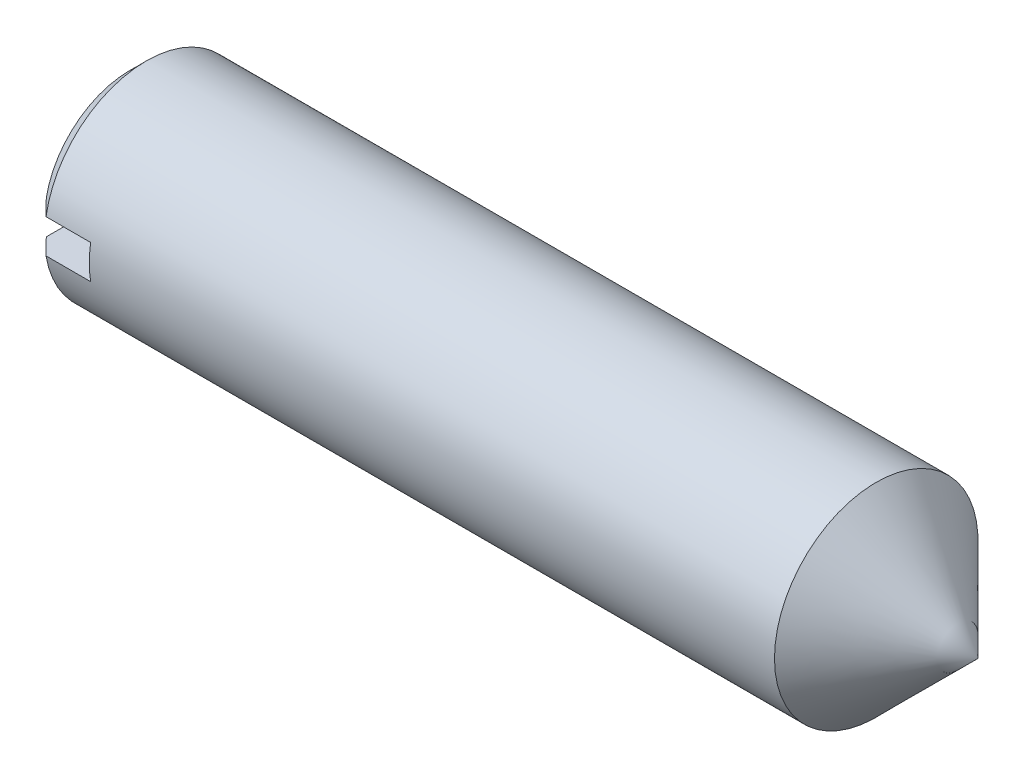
from build123d import *

# Parameters (mm, degrees)
SLOTSKE_W  = 12
SLOTSKE_H  = 2
SLOT_DEPTH = 3.6


with BuildPart() as part:
    # BodySke → BaseBody (revolve)
    with BuildSketch(Plane.XY, mode=Mode.PRIVATE) as basebody_sk:
        Polygon((0, 0), (0, 5.036), (0.964, 6), (44, 6), (50, 0), align=None)
    revolve(basebody_sk.sketch.rotate(Axis((0, 0, 0), (1, 0, 0)), 90), axis=Axis((0, 0, 0), (1, 0, 0)))

    # SlotSke → Slot (cut)
    with BuildSketch(Plane(origin=(0, 0, 0), x_dir=(0, 0, -1), z_dir=(1, 0, 0))):
        Rectangle(SLOTSKE_W, SLOTSKE_H)
    extrude(amount=SLOT_DEPTH, mode=Mode.SUBTRACT)


solid = part.part
